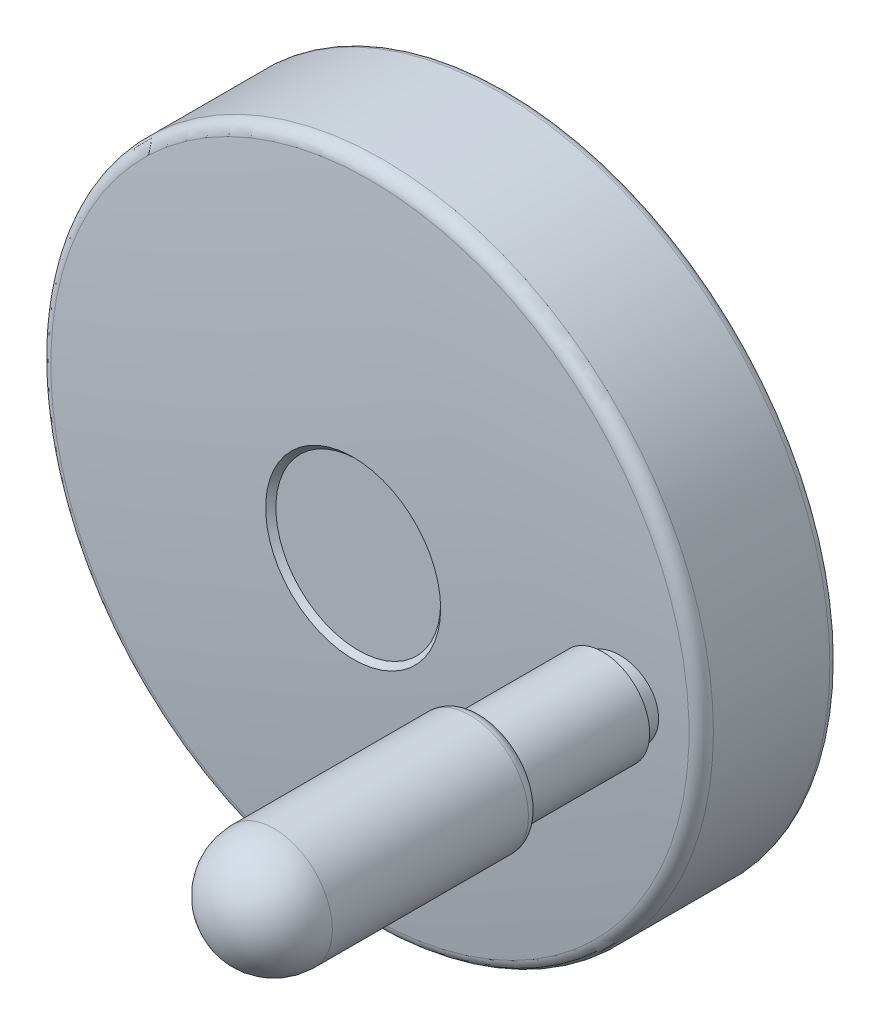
ISO-10303-21;
HEADER;
FILE_DESCRIPTION(('STEP AP214'),'2;1');
FILE_NAME('part.step','',(''),(''),'','','');
FILE_SCHEMA(('AUTOMOTIVE_DESIGN { 1 0 10303 214 1 1 1 1 }'));
ENDSEC;
DATA;
#1=APPLICATION_CONTEXT('core data for automotive mechanical design processes');
#2=APPLICATION_PROTOCOL_DEFINITION('international standard','automotive_design',2000,#1);
#3=PRODUCT_CONTEXT('',#1,'mechanical');
#4=PRODUCT('Part','Part','',(#3));
#5=PRODUCT_RELATED_PRODUCT_CATEGORY('part','',(#4));
#6=PRODUCT_DEFINITION_FORMATION('','',#4);
#7=PRODUCT_DEFINITION_CONTEXT('part definition',#1,'design');
#8=PRODUCT_DEFINITION('design','',#6,#7);
#9=PRODUCT_DEFINITION_SHAPE('','',#8);
#10=(LENGTH_UNIT() NAMED_UNIT(*) SI_UNIT(.MILLI.,.METRE.));
#11=(NAMED_UNIT(*) PLANE_ANGLE_UNIT() SI_UNIT($,.RADIAN.));
#12=(NAMED_UNIT(*) SI_UNIT($,.STERADIAN.) SOLID_ANGLE_UNIT());
#13=UNCERTAINTY_MEASURE_WITH_UNIT(LENGTH_MEASURE(1.E-05),#10,'distance_accuracy_value','');
#14=(GEOMETRIC_REPRESENTATION_CONTEXT(3) GLOBAL_UNCERTAINTY_ASSIGNED_CONTEXT((#13)) GLOBAL_UNIT_ASSIGNED_CONTEXT((#10,
#11,#12)) REPRESENTATION_CONTEXT('',''));
#15=CARTESIAN_POINT('',(0.,0.,0.));
#16=DIRECTION('',(0.,0.,1.));
#17=DIRECTION('',(1.,0.,0.));
#18=AXIS2_PLACEMENT_3D('',#15,#16,#17);
#19=CARTESIAN_POINT('',(0.,0.,34.));
#20=DIRECTION('',(0.,0.,1.));
#21=DIRECTION('',(0.,1.,0.));
#22=AXIS2_PLACEMENT_3D('',#19,#20,#21);
#23=PLANE('',#22);
#24=CARTESIAN_POINT('',(39.,0.,34.));
#25=DIRECTION('',(0.,0.,1.));
#26=DIRECTION('',(0.,1.,0.));
#27=AXIS2_PLACEMENT_3D('',#24,#25,#26);
#28=CIRCLE('',#27,5.4375);
#29=CARTESIAN_POINT('',(39.,5.43749999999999,34.));
#30=VERTEX_POINT('',#29);
#31=EDGE_CURVE('E349',#30,#30,#28,.T.);
#32=ORIENTED_EDGE('',*,*,#31,.F.);
#33=EDGE_LOOP('',(#32));
#34=FACE_BOUND('',#33,.T.);
#35=CARTESIAN_POINT('',(39.,0.,34.));
#36=DIRECTION('',(0.,0.,-1.));
#37=DIRECTION('',(0.,-1.,0.));
#38=AXIS2_PLACEMENT_3D('',#35,#36,#37);
#39=CIRCLE('',#38,6.);
#40=CARTESIAN_POINT('',(39.,-6.,34.));
#41=VERTEX_POINT('',#40);
#42=EDGE_CURVE('E384',#41,#41,#39,.T.);
#43=ORIENTED_EDGE('',*,*,#42,.F.);
#44=EDGE_LOOP('',(#43));
#45=FACE_BOUND('',#44,.T.);
#46=ADVANCED_FACE('F15',(#34,#45),#23,.T.);
#47=CARTESIAN_POINT('',(39.,0.,31.));
#48=DIRECTION('',(0.,0.,-1.));
#49=DIRECTION('',(0.,-1.,0.));
#50=AXIS2_PLACEMENT_3D('',#47,#48,#49);
#51=CYLINDRICAL_SURFACE('',#50,6.);
#52=CARTESIAN_POINT('',(33.,0.,32.74646972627));
#53=CARTESIAN_POINT('',(33.0000009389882,0.167957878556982,32.746469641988));
#54=CARTESIAN_POINT('',(33.0070584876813,0.335946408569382,32.7458350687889));
#55=CARTESIAN_POINT('',(33.0352437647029,0.67076337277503,32.7433007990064));
#56=CARTESIAN_POINT('',(33.0563756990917,0.837591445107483,32.7414007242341));
#57=CARTESIAN_POINT('',(33.1126039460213,1.16913659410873,32.7363449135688));
#58=CARTESIAN_POINT('',(33.1477224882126,1.3338498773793,32.7331871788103));
#59=CARTESIAN_POINT('',(33.2317016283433,1.65984619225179,32.7256359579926));
#60=CARTESIAN_POINT('',(33.2805732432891,1.82112636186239,32.7212414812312));
#61=CARTESIAN_POINT('',(33.3915896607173,2.13868510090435,32.7112588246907));
#62=CARTESIAN_POINT('',(33.4537102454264,2.29497220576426,32.7056728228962));
#63=CARTESIAN_POINT('',(33.5908580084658,2.60181401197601,32.6933399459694));
#64=CARTESIAN_POINT('',(33.6658910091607,2.75236608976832,32.6865925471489));
#65=CARTESIAN_POINT('',(33.8283063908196,3.04660896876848,32.67198682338));
#66=CARTESIAN_POINT('',(33.9156894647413,3.19029938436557,32.6641284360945));
#67=CARTESIAN_POINT('',(34.1021303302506,3.4697365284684,32.6473612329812));
#68=CARTESIAN_POINT('',(34.2011828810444,3.60548678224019,32.6384528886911));
#69=CARTESIAN_POINT('',(34.4105368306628,3.868480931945,32.6196238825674));
#70=CARTESIAN_POINT('',(34.5208648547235,3.99570346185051,32.6097008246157));
#71=CARTESIAN_POINT('',(34.7516660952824,4.24027152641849,32.5889414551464));
#72=CARTESIAN_POINT('',(34.8721294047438,4.35762648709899,32.5781060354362));
#73=CARTESIAN_POINT('',(35.1224921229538,4.58183185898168,32.5555855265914));
#74=CARTESIAN_POINT('',(35.2523959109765,4.68867734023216,32.5439000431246));
#75=CARTESIAN_POINT('',(35.5206970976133,4.89108337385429,32.5197639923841));
#76=CARTESIAN_POINT('',(35.6590964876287,4.98664126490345,32.5073132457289));
#77=CARTESIAN_POINT('',(35.9438733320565,5.16609261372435,32.4816928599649));
#78=CARTESIAN_POINT('',(36.0902767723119,5.24994450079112,32.4685208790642));
#79=CARTESIAN_POINT('',(36.3896344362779,5.40503648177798,32.4415862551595));
#80=CARTESIAN_POINT('',(36.5425910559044,5.47627191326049,32.4278233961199));
#81=CARTESIAN_POINT('',(36.8538629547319,5.60557650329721,32.3998141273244));
#82=CARTESIAN_POINT('',(37.0121762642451,5.66365044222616,32.3855678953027));
#83=CARTESIAN_POINT('',(37.3331552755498,5.7662838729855,32.3566823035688));
#84=CARTESIAN_POINT('',(37.4958225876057,5.8108382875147,32.342042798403));
#85=CARTESIAN_POINT('',(37.8248270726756,5.88621612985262,32.3124319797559));
#86=CARTESIAN_POINT('',(37.9911742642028,5.9169954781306,32.2974597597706));
#87=CARTESIAN_POINT('',(38.3259327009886,5.96441315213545,32.2673279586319));
#88=CARTESIAN_POINT('',(38.4943448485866,5.98104505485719,32.2521682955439));
#89=CARTESIAN_POINT('',(38.8319675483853,6.00002939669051,32.2217754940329));
#90=CARTESIAN_POINT('',(39.00117811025,6.00238166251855,32.2065423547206));
#91=CARTESIAN_POINT('',(39.3391201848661,5.99279224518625,32.1761175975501));
#92=CARTESIAN_POINT('',(39.5078518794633,5.9808570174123,32.1609259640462));
#93=CARTESIAN_POINT('',(39.8440908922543,5.94274356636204,32.1306513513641));
#94=CARTESIAN_POINT('',(40.0115946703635,5.91653385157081,32.1155686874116));
#95=CARTESIAN_POINT('',(40.343743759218,5.85004512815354,32.0856592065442));
#96=CARTESIAN_POINT('',(40.5083901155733,5.80977138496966,32.0708322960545));
#97=CARTESIAN_POINT('',(40.833778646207,5.7154144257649,32.0415285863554));
#98=CARTESIAN_POINT('',(40.9945192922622,5.66132589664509,32.0270519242));
#99=CARTESIAN_POINT('',(41.3108232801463,5.53974661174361,31.9985634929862));
#100=CARTESIAN_POINT('',(41.4663885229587,5.47226084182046,31.9845515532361));
#101=CARTESIAN_POINT('',(41.7712243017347,5.3243780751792,31.9570933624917));
#102=CARTESIAN_POINT('',(41.9204975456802,5.24398670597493,31.9436468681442));
#103=CARTESIAN_POINT('',(42.2117156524,5.07085509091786,31.9174128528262));
#104=CARTESIAN_POINT('',(42.3536622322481,4.97811775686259,31.9046251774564));
#105=CARTESIAN_POINT('',(42.6291782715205,4.7809774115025,31.8798034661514));
#106=CARTESIAN_POINT('',(42.7627516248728,4.67657988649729,31.8677690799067));
#107=CARTESIAN_POINT('',(43.0207558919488,4.45671145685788,31.8445230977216));
#108=CARTESIAN_POINT('',(43.1451777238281,4.34122980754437,31.833312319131));
#109=CARTESIAN_POINT('',(43.3833915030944,4.10054176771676,31.8118477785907));
#110=CARTESIAN_POINT('',(43.497220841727,3.97537268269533,31.8015906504));
#111=CARTESIAN_POINT('',(43.7139888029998,3.71576617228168,31.7820571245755));
#112=CARTESIAN_POINT('',(43.8169224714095,3.58132457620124,31.7727811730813));
#113=CARTESIAN_POINT('',(44.0110846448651,3.30418746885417,31.7552835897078));
#114=CARTESIAN_POINT('',(44.1023139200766,3.1614925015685,31.7470618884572));
#115=CARTESIAN_POINT('',(44.2723701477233,2.86892460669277,31.7317358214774));
#116=CARTESIAN_POINT('',(44.3512027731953,2.71905500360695,31.7246309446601));
#117=CARTESIAN_POINT('',(44.495778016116,2.41348899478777,31.7116006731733));
#118=CARTESIAN_POINT('',(44.5615493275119,2.25780627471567,31.7056726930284));
#119=CARTESIAN_POINT('',(44.6796916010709,1.94153919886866,31.6950243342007));
#120=CARTESIAN_POINT('',(44.7320733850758,1.78095891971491,31.6903029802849));
#121=CARTESIAN_POINT('',(44.8230489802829,1.4561921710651,31.6821029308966));
#122=CARTESIAN_POINT('',(44.8616649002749,1.29201193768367,31.6786222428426));
#123=CARTESIAN_POINT('',(44.924935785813,0.960995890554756,31.6729192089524));
#124=CARTESIAN_POINT('',(44.9495949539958,0.794160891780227,31.6706964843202));
#125=CARTESIAN_POINT('',(44.9781180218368,0.522551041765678,31.6681254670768));
#126=CARTESIAN_POINT('',(44.9863211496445,0.418216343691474,31.6673860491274));
#127=CARTESIAN_POINT('',(44.9972624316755,0.209258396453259,31.6663998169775));
#128=CARTESIAN_POINT('',(45.000000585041,0.104635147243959,31.6661530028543));
#129=CARTESIAN_POINT('',(44.999999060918,-0.167955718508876,31.6661531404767));
#130=CARTESIAN_POINT('',(44.9929416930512,-0.335942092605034,31.6667892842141));
#131=CARTESIAN_POINT('',(44.9647571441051,-0.670754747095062,31.6693297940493));
#132=CARTESIAN_POINT('',(44.9436257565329,-0.837580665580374,31.6712345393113));
#133=CARTESIAN_POINT('',(44.8873989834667,-1.16912152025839,31.6763026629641));
#134=CARTESIAN_POINT('',(44.8522813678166,-1.33383266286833,31.6794680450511));
#135=CARTESIAN_POINT('',(44.7683044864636,-1.65982470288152,31.6870373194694));
#136=CARTESIAN_POINT('',(44.7194342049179,-1.82110273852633,31.6914422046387));
#137=CARTESIAN_POINT('',(44.6084209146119,-2.13865716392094,31.7014481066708));
#138=CARTESIAN_POINT('',(44.5463021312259,-2.29494209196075,31.7070469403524));
#139=CARTESIAN_POINT('',(44.4091584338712,-2.60177964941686,31.7194075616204));
#140=CARTESIAN_POINT('',(44.3341276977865,-2.75232965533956,31.7261698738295));
#141=CARTESIAN_POINT('',(44.1717173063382,-3.04656858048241,31.7408070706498));
#142=CARTESIAN_POINT('',(44.0843369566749,-3.19025711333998,31.7486820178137));
#143=CARTESIAN_POINT('',(43.8979019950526,-3.46969074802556,31.7654835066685));
#144=CARTESIAN_POINT('',(43.7988526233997,-3.60543937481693,31.7744095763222));
#145=CARTESIAN_POINT('',(43.5895042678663,-3.86843211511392,31.7932748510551));
#146=CARTESIAN_POINT('',(43.4791785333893,-3.99565476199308,31.8032164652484));
#147=CARTESIAN_POINT('',(43.2483820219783,-4.24022325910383,31.8240130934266));
#148=CARTESIAN_POINT('',(43.127921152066,-4.3575785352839,31.8348672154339));
#149=CARTESIAN_POINT('',(42.8775634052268,-4.58178480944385,31.8574247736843));
#150=CARTESIAN_POINT('',(42.7476621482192,-4.68863087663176,31.8691286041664));
#151=CARTESIAN_POINT('',(42.4793660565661,-4.89103839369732,31.8933004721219));
#152=CARTESIAN_POINT('',(42.3409692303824,-4.98659718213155,31.9057686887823));
#153=CARTESIAN_POINT('',(42.0561950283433,-5.16605221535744,31.9314229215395));
#154=CARTESIAN_POINT('',(41.9097915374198,-5.24990668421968,31.9446112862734));
#155=CARTESIAN_POINT('',(41.6104334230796,-5.40500375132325,31.9715768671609));
#156=CARTESIAN_POINT('',(41.457476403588,-5.47624168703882,31.9853542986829));
#157=CARTESIAN_POINT('',(41.1462033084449,-5.6055511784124,32.0133904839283));
#158=CARTESIAN_POINT('',(40.9878892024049,-5.66362751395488,32.0276490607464));
#159=CARTESIAN_POINT('',(40.6669081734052,-5.76626558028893,32.0565567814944));
#160=CARTESIAN_POINT('',(40.5042396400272,-5.81082223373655,32.0712060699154));
#161=CARTESIAN_POINT('',(40.175231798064,-5.88620444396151,32.1008336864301));
#162=CARTESIAN_POINT('',(40.0088824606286,-5.91698588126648,32.1158129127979));
#163=CARTESIAN_POINT('',(39.6741192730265,-5.96440735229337,32.1459556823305));
#164=CARTESIAN_POINT('',(39.505704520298,-5.98104096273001,32.1611193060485));
#165=CARTESIAN_POINT('',(39.1680761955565,-6.00002825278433,32.1915168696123));
#166=CARTESIAN_POINT('',(38.9988626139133,-6.00238175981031,32.2067508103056));
#167=CARTESIAN_POINT('',(38.6609141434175,-5.99279427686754,32.2371739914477));
#168=CARTESIAN_POINT('',(38.4921790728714,-5.98085974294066,32.2523632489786));
#169=CARTESIAN_POINT('',(38.1559354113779,-5.94274733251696,32.2826297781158));
#170=CARTESIAN_POINT('',(37.9884303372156,-5.91653816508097,32.2977067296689));
#171=CARTESIAN_POINT('',(37.656278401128,-5.85005025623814,32.3276018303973));
#172=CARTESIAN_POINT('',(37.4916304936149,-5.80977678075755,32.3424200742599));
#173=CARTESIAN_POINT('',(37.1662386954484,-5.71542003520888,32.3717037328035));
#174=CARTESIAN_POINT('',(37.0054963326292,-5.66133145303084,32.3861690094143));
#175=CARTESIAN_POINT('',(36.6891888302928,-5.53975171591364,32.414632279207));
#176=CARTESIAN_POINT('',(36.5336217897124,-5.47226554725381,32.4286304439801));
#177=CARTESIAN_POINT('',(36.2287851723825,-5.32438296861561,32.4560588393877));
#178=CARTESIAN_POINT('',(36.0795127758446,-5.24399241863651,32.4694893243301));
#179=CARTESIAN_POINT('',(35.7882961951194,-5.07086255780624,32.4956897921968));
#180=CARTESIAN_POINT('',(35.6463502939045,-4.97812615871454,32.5084599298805));
#181=CARTESIAN_POINT('',(35.3708354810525,-4.78098781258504,32.5332455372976));
#182=CARTESIAN_POINT('',(35.2372626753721,-4.67659135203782,32.5452613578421));
#183=CARTESIAN_POINT('',(34.9792593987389,-4.45672520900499,32.5684696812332));
#184=CARTESIAN_POINT('',(34.8548380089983,-4.34124478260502,32.5796613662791));
#185=CARTESIAN_POINT('',(34.6166255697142,-4.10055993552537,32.6010877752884));
#186=CARTESIAN_POINT('',(34.5027970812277,-3.97539286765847,32.6113258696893));
#187=CARTESIAN_POINT('',(34.2860305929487,-3.7157906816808,32.6308219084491));
#188=CARTESIAN_POINT('',(34.1830975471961,-3.58135139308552,32.6400794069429));
#189=CARTESIAN_POINT('',(33.9889363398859,-3.30421917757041,32.6575412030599));
#190=CARTESIAN_POINT('',(33.8977074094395,-3.1615267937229,32.6657455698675));
#191=CARTESIAN_POINT('',(33.7276515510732,-2.86896433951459,32.6810385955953));
#192=CARTESIAN_POINT('',(33.6488189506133,-2.71909759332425,32.6881277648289));
#193=CARTESIAN_POINT('',(33.504242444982,-2.41353555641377,32.7011288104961));
#194=CARTESIAN_POINT('',(33.4384700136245,-2.25785387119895,32.7070432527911));
#195=CARTESIAN_POINT('',(33.3203254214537,-1.94158894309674,32.7176669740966));
#196=CARTESIAN_POINT('',(33.2679424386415,-1.78100977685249,32.7223772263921));
#197=CARTESIAN_POINT('',(33.1769643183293,-1.45624526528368,32.7305578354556));
#198=CARTESIAN_POINT('',(33.1383470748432,-1.2920661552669,32.7340301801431));
#199=CARTESIAN_POINT('',(33.0750733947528,-0.961052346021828,32.7397195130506));
#200=CARTESIAN_POINT('',(33.050412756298,-0.794218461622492,32.7419368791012));
#201=CARTESIAN_POINT('',(33.0218860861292,-0.522600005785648,32.7445018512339));
#202=CARTESIAN_POINT('',(33.0136814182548,-0.418255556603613,32.7452395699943));
#203=CARTESIAN_POINT('',(33.0027380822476,-0.209278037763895,32.7462235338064));
#204=CARTESIAN_POINT('',(32.99999941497,-0.10464496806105,32.7464697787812));
#205=CARTESIAN_POINT('',(33.,0.,32.74646972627));
#206=B_SPLINE_CURVE_WITH_KNOTS('',3,(#52,#53,#54,#55,#56,#57,#58,#59,#60,#61,#62,#63,#64,#65,
#66,#67,#68,#69,#70,#71,#72,#73,#74,#75,#76,#77,#78,#79,#80,#81,#82,#83,#84,#85,#86,#87,#88,#89,
#90,#91,#92,#93,#94,#95,#96,#97,#98,#99,#100,#101,#102,#103,#104,#105,#106,#107,#108,#109,#110,
#111,#112,#113,#114,#115,#116,#117,#118,#119,#120,#121,#122,#123,#124,#125,#126,#127,#128,#129,
#130,#131,#132,#133,#134,#135,#136,#137,#138,#139,#140,#141,#142,#143,#144,#145,#146,#147,#148,
#149,#150,#151,#152,#153,#154,#155,#156,#157,#158,#159,#160,#161,#162,#163,#164,#165,#166,#167,
#168,#169,#170,#171,#172,#173,#174,#175,#176,#177,#178,#179,#180,#181,#182,#183,#184,#185,#186,
#187,#188,#189,#190,#191,#192,#193,#194,#195,#196,#197,#198,#199,#200,#201,#202,#203,#204,#205),
.UNSPECIFIED.,.T.,.F.,(4,2,2,2,2,2,2,2,2,2,2,2,2,2,2,2,2,2,2,2,2,2,2,2,2,2,2,2,2,2,2,2,2,2,2,2,
2,2,2,2,2,2,2,2,2,2,2,2,2,2,2,2,2,2,2,2,2,2,2,2,2,2,2,2,2,2,2,2,2,2,2,2,2,2,2,2,4),(0.,
0.503777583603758,1.00770578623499,1.51243812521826,2.01757594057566,2.52179820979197,
3.02624843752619,3.53072698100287,4.03497981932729,4.54045215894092,5.04543602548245,
5.55065565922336,6.05599417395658,6.56308393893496,7.07036071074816,7.57745293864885,
8.0847353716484,8.59362967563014,9.10275489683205,9.61188629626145,10.1207877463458,
10.6308164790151,11.1406544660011,11.6506888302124,12.1605337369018,12.6701569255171,
13.1796601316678,13.6889246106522,14.1986878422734,14.7065773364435,15.2146967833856,
15.722782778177,16.2306355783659,16.7373600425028,17.2436736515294,17.7491703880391,
18.2545148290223,18.5683603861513,18.8822059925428,19.3859771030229,19.8898988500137,
20.3946247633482,20.8997561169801,21.4039716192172,21.908415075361,22.4128869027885,
22.9171330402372,23.4226044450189,23.9275873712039,24.4328061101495,24.9381437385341,
25.4452412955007,25.9525258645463,26.4596259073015,26.9669161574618,27.4758197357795,
27.9849542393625,28.494094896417,29.0030055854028,29.5130363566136,30.0228763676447,
30.5329127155,31.0427595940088,31.5523755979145,32.0618716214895,32.5711289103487,
33.08088491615,33.5887647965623,34.0968746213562,34.6049510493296,35.1127943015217,
35.619515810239,36.1258264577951,36.6313203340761,37.1366619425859,37.450536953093,
37.7644120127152),.UNSPECIFIED.);
#207=CARTESIAN_POINT('',(33.,0.,32.74646972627));
#208=VERTEX_POINT('',#207);
#209=EDGE_CURVE('E353',#208,#208,#206,.T.);
#210=ORIENTED_EDGE('',*,*,#209,.F.);
#211=EDGE_LOOP('',(#210));
#212=FACE_BOUND('',#211,.T.);
#213=ORIENTED_EDGE('',*,*,#42,.T.);
#214=EDGE_LOOP('',(#213));
#215=FACE_BOUND('',#214,.T.);
#216=ADVANCED_FACE('F364',(#212,#215),#51,.T.);
#217=CARTESIAN_POINT('',(2.81085775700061E-13,0.,-401.000000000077));
#218=DIRECTION('',(-1.,0.,0.));
#219=DIRECTION('',(0.,0.,1.));
#220=AXIS2_PLACEMENT_3D('',#217,#218,#219);
#221=SPHERICAL_SURFACE('',#220,435.000000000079);
#222=CARTESIAN_POINT('',(0.,0.,31.2057017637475));
#223=DIRECTION('',(0.,0.,1.));
#224=DIRECTION('',(0.,1.,0.));
#225=AXIS2_PLACEMENT_3D('',#222,#223,#224);
#226=CIRCLE('',#225,49.2263279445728);
#227=CARTESIAN_POINT('',(0.,49.2263279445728,31.2057017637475));
#228=VERTEX_POINT('',#227);
#229=EDGE_CURVE('E346',#228,#228,#226,.T.);
#230=ORIENTED_EDGE('',*,*,#229,.T.);
#231=EDGE_LOOP('',(#230));
#232=FACE_BOUND('',#231,.T.);
#233=CARTESIAN_POINT('',(0.,0.,33.7904667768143));
#234=DIRECTION('',(0.,0.,1.));
#235=DIRECTION('',(1.,0.,0.));
#236=AXIS2_PLACEMENT_3D('',#233,#234,#235);
#237=CIRCLE('',#236,13.5);
#238=CARTESIAN_POINT('',(13.5,0.,33.7904667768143));
#239=VERTEX_POINT('',#238);
#240=EDGE_CURVE('E350',#239,#239,#237,.F.);
#241=ORIENTED_EDGE('',*,*,#240,.T.);
#242=EDGE_LOOP('',(#241));
#243=FACE_BOUND('',#242,.T.);
#244=ORIENTED_EDGE('',*,*,#209,.T.);
#245=EDGE_LOOP('',(#244));
#246=FACE_BOUND('',#245,.T.);
#247=ADVANCED_FACE('F368',(#232,#243,#246),#221,.T.);
#248=CARTESIAN_POINT('',(0.,0.,29.21854911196));
#249=DIRECTION('',(0.,0.,1.));
#250=DIRECTION('',(0.,1.,0.));
#251=AXIS2_PLACEMENT_3D('',#248,#249,#250);
#252=TOROIDAL_SURFACE('',#251,49.,2.00000000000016);
#253=CARTESIAN_POINT('',(0.,0.,29.21854911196));
#254=DIRECTION('',(0.,0.,1.));
#255=DIRECTION('',(0.,1.,0.));
#256=AXIS2_PLACEMENT_3D('',#253,#254,#255);
#257=CIRCLE('',#256,51.);
#258=CARTESIAN_POINT('',(0.,51.,29.21854911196));
#259=VERTEX_POINT('',#258);
#260=EDGE_CURVE('E361',#259,#259,#257,.T.);
#261=ORIENTED_EDGE('',*,*,#260,.T.);
#262=EDGE_LOOP('',(#261));
#263=FACE_BOUND('',#262,.T.);
#264=ORIENTED_EDGE('',*,*,#229,.F.);
#265=EDGE_LOOP('',(#264));
#266=FACE_BOUND('',#265,.T.);
#267=ADVANCED_FACE('F373',(#263,#266),#252,.T.);
#268=CARTESIAN_POINT('',(0.,0.,33.7904667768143));
#269=DIRECTION('',(0.,0.,1.));
#270=DIRECTION('',(1.,0.,0.));
#271=AXIS2_PLACEMENT_3D('',#268,#269,#270);
#272=CONICAL_SURFACE('',#271,13.5,0.78539816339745);
#273=CARTESIAN_POINT('',(0.,0.,33.));
#274=DIRECTION('',(0.,0.,1.));
#275=DIRECTION('',(1.,0.,0.));
#276=AXIS2_PLACEMENT_3D('',#273,#274,#275);
#277=CIRCLE('',#276,12.7095332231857);
#278=CARTESIAN_POINT('',(12.7095332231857,0.,33.));
#279=VERTEX_POINT('',#278);
#280=EDGE_CURVE('E362',#279,#279,#277,.T.);
#281=ORIENTED_EDGE('',*,*,#280,.F.);
#282=EDGE_LOOP('',(#281));
#283=FACE_BOUND('',#282,.T.);
#284=ORIENTED_EDGE('',*,*,#240,.F.);
#285=EDGE_LOOP('',(#284));
#286=FACE_BOUND('',#285,.T.);
#287=ADVANCED_FACE('F582',(#283,#286),#272,.F.);
#288=CARTESIAN_POINT('',(0.,0.,20.2342745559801));
#289=DIRECTION('',(0.,0.,-1.));
#290=DIRECTION('',(-1.,0.,0.));
#291=AXIS2_PLACEMENT_3D('',#288,#289,#290);
#292=CYLINDRICAL_SURFACE('',#291,51.);
#293=CARTESIAN_POINT('',(0.,0.,11.25));
#294=DIRECTION('',(0.,0.,-1.));
#295=DIRECTION('',(-1.,0.,0.));
#296=AXIS2_PLACEMENT_3D('',#293,#294,#295);
#297=CIRCLE('',#296,51.);
#298=CARTESIAN_POINT('',(-51.,0.,11.25));
#299=VERTEX_POINT('',#298);
#300=EDGE_CURVE('E381',#299,#299,#297,.F.);
#301=ORIENTED_EDGE('',*,*,#300,.T.);
#302=EDGE_LOOP('',(#301));
#303=FACE_BOUND('',#302,.T.);
#304=ORIENTED_EDGE('',*,*,#260,.F.);
#305=EDGE_LOOP('',(#304));
#306=FACE_BOUND('',#305,.T.);
#307=ADVANCED_FACE('F574',(#303,#306),#292,.T.);
#308=CARTESIAN_POINT('',(-6.35476661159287,0.,33.));
#309=DIRECTION('',(0.,0.,1.));
#310=DIRECTION('',(0.,1.,0.));
#311=AXIS2_PLACEMENT_3D('',#308,#309,#310);
#312=PLANE('',#311);
#313=ORIENTED_EDGE('',*,*,#280,.T.);
#314=EDGE_LOOP('',(#313));
#315=FACE_BOUND('',#314,.T.);
#316=ADVANCED_FACE('F396',(#315),#312,.T.);
#317=CARTESIAN_POINT('',(0.,0.,11.25));
#318=DIRECTION('',(0.,0.,1.));
#319=DIRECTION('',(0.,1.,0.));
#320=AXIS2_PLACEMENT_3D('',#317,#318,#319);
#321=TOROIDAL_SURFACE('',#320,49.75,1.25);
#322=ORIENTED_EDGE('',*,*,#300,.F.);
#323=EDGE_LOOP('',(#322));
#324=FACE_BOUND('',#323,.T.);
#325=CARTESIAN_POINT('',(0.,0.,10.));
#326=DIRECTION('',(0.,0.,1.));
#327=DIRECTION('',(0.,-1.,0.));
#328=AXIS2_PLACEMENT_3D('',#325,#326,#327);
#329=CIRCLE('',#328,49.75);
#330=CARTESIAN_POINT('',(0.,-49.75,10.));
#331=VERTEX_POINT('',#330);
#332=CARTESIAN_POINT('',(0.,49.75,10.));
#333=VERTEX_POINT('',#332);
#334=EDGE_CURVE('E436',#331,#333,#329,.T.);
#335=ORIENTED_EDGE('',*,*,#334,.T.);
#336=CARTESIAN_POINT('',(0.,0.,10.));
#337=DIRECTION('',(0.,0.,1.));
#338=DIRECTION('',(0.,1.,0.));
#339=AXIS2_PLACEMENT_3D('',#336,#337,#338);
#340=CIRCLE('',#339,49.75);
#341=CARTESIAN_POINT('',(-49.75,0.,10.));
#342=VERTEX_POINT('',#341);
#343=EDGE_CURVE('E435',#333,#342,#340,.T.);
#344=ORIENTED_EDGE('',*,*,#343,.T.);
#345=CARTESIAN_POINT('',(0.,0.,10.));
#346=DIRECTION('',(0.,0.,1.));
#347=DIRECTION('',(-1.,0.,0.));
#348=AXIS2_PLACEMENT_3D('',#345,#346,#347);
#349=CIRCLE('',#348,49.75);
#350=EDGE_CURVE('E35',#342,#331,#349,.T.);
#351=ORIENTED_EDGE('',*,*,#350,.T.);
#352=EDGE_LOOP('',(#335,#344,#351));
#353=FACE_BOUND('',#352,.T.);
#354=ADVANCED_FACE('F390',(#324,#353),#321,.T.);
#355=CARTESIAN_POINT('',(-49.355,0.,10.));
#356=DIRECTION('',(0.,0.,-1.));
#357=DIRECTION('',(-1.,0.,0.));
#358=AXIS2_PLACEMENT_3D('',#355,#356,#357);
#359=PLANE('',#358);
#360=CARTESIAN_POINT('',(0.,0.,10.));
#361=DIRECTION('',(0.,0.,-1.));
#362=DIRECTION('',(-1.,0.,0.));
#363=AXIS2_PLACEMENT_3D('',#360,#361,#362);
#364=CIRCLE('',#363,48.96);
#365=CARTESIAN_POINT('',(-48.96,0.,9.99999999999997));
#366=VERTEX_POINT('',#365);
#367=EDGE_CURVE('E276',#366,#366,#364,.F.);
#368=ORIENTED_EDGE('',*,*,#367,.T.);
#369=EDGE_LOOP('',(#368));
#370=FACE_BOUND('',#369,.T.);
#371=ORIENTED_EDGE('',*,*,#343,.F.);
#372=ORIENTED_EDGE('',*,*,#334,.F.);
#373=ORIENTED_EDGE('',*,*,#350,.F.);
#374=EDGE_LOOP('',(#371,#372,#373));
#375=FACE_BOUND('',#374,.T.);
#376=ADVANCED_FACE('F395',(#370,#375),#359,.T.);
#377=CARTESIAN_POINT('',(0.,0.,11.8));
#378=DIRECTION('',(0.,0.,-1.));
#379=DIRECTION('',(-1.,0.,0.));
#380=AXIS2_PLACEMENT_3D('',#377,#378,#379);
#381=CYLINDRICAL_SURFACE('',#380,48.96);
#382=ORIENTED_EDGE('',*,*,#367,.F.);
#383=EDGE_LOOP('',(#382));
#384=FACE_BOUND('',#383,.T.);
#385=CARTESIAN_POINT('',(0.,0.,13.6));
#386=DIRECTION('',(0.,0.,-1.));
#387=DIRECTION('',(-1.,0.,0.));
#388=AXIS2_PLACEMENT_3D('',#385,#386,#387);
#389=CIRCLE('',#388,48.96);
#390=CARTESIAN_POINT('',(-48.96,0.,13.6));
#391=VERTEX_POINT('',#390);
#392=EDGE_CURVE('E277',#391,#391,#389,.T.);
#393=ORIENTED_EDGE('',*,*,#392,.F.);
#394=EDGE_LOOP('',(#393));
#395=FACE_BOUND('',#394,.T.);
#396=ADVANCED_FACE('F270',(#384,#395),#381,.F.);
#397=CARTESIAN_POINT('',(39.,0.,25.5));
#398=DIRECTION('',(0.,0.,1.));
#399=DIRECTION('',(0.,1.,0.));
#400=AXIS2_PLACEMENT_3D('',#397,#398,#399);
#401=CYLINDRICAL_SURFACE('',#400,2.4585);
#402=CARTESIAN_POINT('',(39.,0.,21.0719999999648));
#403=DIRECTION('',(0.,0.,1.));
#404=DIRECTION('',(0.,1.,0.));
#405=AXIS2_PLACEMENT_3D('',#402,#403,#404);
#406=CIRCLE('',#405,2.4585);
#407=CARTESIAN_POINT('',(39.,2.45849999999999,21.0719999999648));
#408=VERTEX_POINT('',#407);
#409=EDGE_CURVE('E9',#408,#408,#406,.T.);
#410=ORIENTED_EDGE('',*,*,#409,.T.);
#411=EDGE_LOOP('',(#410));
#412=FACE_BOUND('',#411,.T.);
#413=CARTESIAN_POINT('',(39.,0.,17.5415));
#414=DIRECTION('',(0.,0.,1.));
#415=DIRECTION('',(0.,1.,0.));
#416=AXIS2_PLACEMENT_3D('',#413,#414,#415);
#417=CIRCLE('',#416,2.4585);
#418=CARTESIAN_POINT('',(39.,2.4585,17.5415));
#419=VERTEX_POINT('',#418);
#420=EDGE_CURVE('E274',#419,#419,#417,.T.);
#421=ORIENTED_EDGE('',*,*,#420,.F.);
#422=EDGE_LOOP('',(#421));
#423=FACE_BOUND('',#422,.T.);
#424=ADVANCED_FACE('F266',(#412,#423),#401,.F.);
#425=CARTESIAN_POINT('',(39.,0.,17.0000000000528));
#426=DIRECTION('',(0.,0.,-1.));
#427=DIRECTION('',(0.,-1.,0.));
#428=AXIS2_PLACEMENT_3D('',#425,#426,#427);
#429=CONICAL_SURFACE('',#428,2.99999999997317,0.785398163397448);
#430=ORIENTED_EDGE('',*,*,#420,.T.);
#431=EDGE_LOOP('',(#430));
#432=FACE_BOUND('',#431,.T.);
#433=CARTESIAN_POINT('',(39.,0.,16.9999999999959));
#434=DIRECTION('',(0.,0.,-1.));
#435=DIRECTION('',(0.,-1.,0.));
#436=AXIS2_PLACEMENT_3D('',#433,#434,#435);
#437=CIRCLE('',#436,3.00000000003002);
#438=CARTESIAN_POINT('',(39.,-3.00000000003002,16.9999999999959));
#439=VERTEX_POINT('',#438);
#440=EDGE_CURVE('E283',#439,#439,#437,.F.);
#441=ORIENTED_EDGE('',*,*,#440,.F.);
#442=EDGE_LOOP('',(#441));
#443=FACE_BOUND('',#442,.T.);
#444=ADVANCED_FACE('F269',(#432,#443),#429,.F.);
#445=CARTESIAN_POINT('',(42.3,0.,17.));
#446=DIRECTION('',(0.,0.,1.));
#447=DIRECTION('',(0.,1.,0.));
#448=AXIS2_PLACEMENT_3D('',#445,#446,#447);
#449=PLANE('',#448);
#450=ORIENTED_EDGE('',*,*,#440,.T.);
#451=EDGE_LOOP('',(#450));
#452=FACE_BOUND('',#451,.T.);
#453=CARTESIAN_POINT('',(39.,0.,17.));
#454=DIRECTION('',(0.,0.,1.));
#455=DIRECTION('',(0.,1.,0.));
#456=AXIS2_PLACEMENT_3D('',#453,#454,#455);
#457=CIRCLE('',#456,3.6);
#458=CARTESIAN_POINT('',(39.,3.6,17.));
#459=VERTEX_POINT('',#458);
#460=EDGE_CURVE('E291',#459,#459,#457,.T.);
#461=ORIENTED_EDGE('',*,*,#460,.F.);
#462=EDGE_LOOP('',(#461));
#463=FACE_BOUND('',#462,.T.);
#464=ADVANCED_FACE('F489',(#452,#463),#449,.F.);
#465=CARTESIAN_POINT('',(39.,0.,8.5));
#466=DIRECTION('',(0.,0.,1.));
#467=DIRECTION('',(0.,1.,0.));
#468=AXIS2_PLACEMENT_3D('',#465,#466,#467);
#469=CYLINDRICAL_SURFACE('',#468,3.6);
#470=CARTESIAN_POINT('',(35.6551589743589,-1.33117936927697,13.6));
#471=CARTESIAN_POINT('',(35.6298127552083,-1.26750935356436,13.6277047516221));
#472=CARTESIAN_POINT('',(35.6060345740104,-1.2024530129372,13.6537276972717));
#473=CARTESIAN_POINT('',(35.5619033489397,-1.06975467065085,13.7020707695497));
#474=CARTESIAN_POINT('',(35.5415545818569,-1.00210956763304,13.7243862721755));
#475=CARTESIAN_POINT('',(35.5046580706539,-0.8646634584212,13.7648801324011));
#476=CARTESIAN_POINT('',(35.488105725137,-0.794865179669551,13.7830634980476));
#477=CARTESIAN_POINT('',(35.4590718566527,-0.653477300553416,13.8149769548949));
#478=CARTESIAN_POINT('',(35.4465875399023,-0.581888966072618,13.8287101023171));
#479=CARTESIAN_POINT('',(35.4242827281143,-0.425901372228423,13.853255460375));
#480=CARTESIAN_POINT('',(35.4151960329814,-0.341266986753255,13.8632619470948));
#481=CARTESIAN_POINT('',(35.4030565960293,-0.171085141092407,13.8766320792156));
#482=CARTESIAN_POINT('',(35.4000006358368,-0.0855381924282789,13.879999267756));
#483=CARTESIAN_POINT('',(35.3999994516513,0.0737685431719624,13.8800006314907));
#484=CARTESIAN_POINT('',(35.4022712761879,0.147530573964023,13.8774974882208));
#485=CARTESIAN_POINT('',(35.411308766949,0.294474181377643,13.8675430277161));
#486=CARTESIAN_POINT('',(35.4180762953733,0.367655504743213,13.8600896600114));
#487=CARTESIAN_POINT('',(35.4359822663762,0.512981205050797,13.840379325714));
#488=CARTESIAN_POINT('',(35.4471299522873,0.585123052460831,13.8281122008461));
#489=CARTESIAN_POINT('',(35.4735727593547,0.727717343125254,13.7990348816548));
#490=CARTESIAN_POINT('',(35.4888686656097,0.798169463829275,13.7822238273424));
#491=CARTESIAN_POINT('',(35.5261228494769,0.948194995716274,13.741315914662));
#492=CARTESIAN_POINT('',(35.5487589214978,1.02739778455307,13.7164800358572));
#493=CARTESIAN_POINT('',(35.5986334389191,1.18207465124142,13.6618284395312));
#494=CARTESIAN_POINT('',(35.625847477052,1.25756589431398,13.6320391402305));
#495=CARTESIAN_POINT('',(35.6551589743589,1.33117936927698,13.6));
#496=B_SPLINE_CURVE_WITH_KNOTS('',3,(#470,#471,#472,#473,#474,#475,#476,#477,#478,#479,#480,
#481,#482,#483,#484,#485,#486,#487,#488,#489,#490,#491,#492,#493,#494,#495),.UNSPECIFIED.,.F.,
.F.,(4,2,2,2,2,2,2,2,2,2,2,2,4),(0.,0.221744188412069,0.443762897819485,0.665511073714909,
0.887106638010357,1.14375645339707,1.40026926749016,1.6214871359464,1.84279669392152,
2.06457580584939,2.28639692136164,2.54414214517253,2.80055440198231),.UNSPECIFIED.);
#497=CARTESIAN_POINT('',(35.655158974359,-1.3311793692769,13.6));
#498=VERTEX_POINT('',#497);
#499=CARTESIAN_POINT('',(35.655158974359,1.33117936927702,13.6));
#500=VERTEX_POINT('',#499);
#501=EDGE_CURVE('E300',#498,#500,#496,.T.);
#502=ORIENTED_EDGE('',*,*,#501,.T.);
#503=CARTESIAN_POINT('',(39.,0.,13.6));
#504=DIRECTION('',(0.,0.,1.));
#505=DIRECTION('',(0.,1.,0.));
#506=AXIS2_PLACEMENT_3D('',#503,#504,#505);
#507=CIRCLE('',#506,3.6);
#508=EDGE_CURVE('E295',#498,#500,#507,.T.);
#509=ORIENTED_EDGE('',*,*,#508,.F.);
#510=EDGE_LOOP('',(#502,#509));
#511=FACE_BOUND('',#510,.T.);
#512=ORIENTED_EDGE('',*,*,#460,.T.);
#513=EDGE_LOOP('',(#512));
#514=FACE_BOUND('',#513,.T.);
#515=ADVANCED_FACE('F460',(#511,#514),#469,.F.);
#516=CARTESIAN_POINT('',(0.,0.,13.6));
#517=DIRECTION('',(0.,0.,-1.));
#518=DIRECTION('',(-1.,0.,0.));
#519=AXIS2_PLACEMENT_3D('',#516,#517,#518);
#520=CONICAL_SURFACE('',#519,35.68,0.785398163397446);
#521=CARTESIAN_POINT('',(0.,0.,14.6));
#522=DIRECTION('',(0.,0.,-1.));
#523=DIRECTION('',(-1.,0.,0.));
#524=AXIS2_PLACEMENT_3D('',#521,#522,#523);
#525=CIRCLE('',#524,34.68);
#526=CARTESIAN_POINT('',(-34.68,0.,14.6));
#527=VERTEX_POINT('',#526);
#528=EDGE_CURVE('E296',#527,#527,#525,.T.);
#529=ORIENTED_EDGE('',*,*,#528,.F.);
#530=EDGE_LOOP('',(#529));
#531=FACE_BOUND('',#530,.T.);
#532=CARTESIAN_POINT('',(0.,0.,13.6));
#533=DIRECTION('',(0.,0.,-1.));
#534=DIRECTION('',(-1.,0.,0.));
#535=AXIS2_PLACEMENT_3D('',#532,#533,#534);
#536=CIRCLE('',#535,35.68);
#537=EDGE_CURVE('E299',#500,#498,#536,.F.);
#538=ORIENTED_EDGE('',*,*,#537,.F.);
#539=ORIENTED_EDGE('',*,*,#501,.F.);
#540=EDGE_LOOP('',(#538,#539));
#541=FACE_BOUND('',#540,.T.);
#542=ADVANCED_FACE('F464',(#531,#541),#520,.F.);
#543=CARTESIAN_POINT('',(-41.1063675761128,0.,13.6));
#544=DIRECTION('',(0.,0.,-1.));
#545=DIRECTION('',(0.,-1.,0.));
#546=AXIS2_PLACEMENT_3D('',#543,#544,#545);
#547=PLANE('',#546);
#548=CARTESIAN_POINT('',(0.,0.,13.6));
#549=DIRECTION('',(0.,0.,1.));
#550=DIRECTION('',(1.,0.,0.));
#551=AXIS2_PLACEMENT_3D('',#548,#549,#550);
#552=CIRCLE('',#551,46.5327351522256);
#553=CARTESIAN_POINT('',(46.5327351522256,0.,13.6));
#554=VERTEX_POINT('',#553);
#555=EDGE_CURVE('E448',#554,#554,#552,.T.);
#556=ORIENTED_EDGE('',*,*,#555,.F.);
#557=EDGE_LOOP('',(#556));
#558=FACE_BOUND('',#557,.T.);
#559=ORIENTED_EDGE('',*,*,#508,.T.);
#560=ORIENTED_EDGE('',*,*,#537,.T.);
#561=EDGE_LOOP('',(#559,#560));
#562=FACE_BOUND('',#561,.T.);
#563=ADVANCED_FACE('F468',(#558,#562),#547,.T.);
#564=CARTESIAN_POINT('',(0.,0.,19.0568720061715));
#565=DIRECTION('',(0.,0.,-1.));
#566=DIRECTION('',(-1.,0.,0.));
#567=AXIS2_PLACEMENT_3D('',#564,#565,#566);
#568=CYLINDRICAL_SURFACE('',#567,34.68);
#569=CARTESIAN_POINT('',(0.,0.,23.513744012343));
#570=DIRECTION('',(0.,0.,-1.));
#571=DIRECTION('',(-1.,0.,0.));
#572=AXIS2_PLACEMENT_3D('',#569,#570,#571);
#573=CIRCLE('',#572,34.68);
#574=CARTESIAN_POINT('',(-34.68,0.,23.513744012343));
#575=VERTEX_POINT('',#574);
#576=EDGE_CURVE('E301',#575,#575,#573,.T.);
#577=ORIENTED_EDGE('',*,*,#576,.F.);
#578=EDGE_LOOP('',(#577));
#579=FACE_BOUND('',#578,.T.);
#580=ORIENTED_EDGE('',*,*,#528,.T.);
#581=EDGE_LOOP('',(#580));
#582=FACE_BOUND('',#581,.T.);
#583=ADVANCED_FACE('F316',(#579,#582),#568,.F.);
#584=CARTESIAN_POINT('',(0.,0.,23.8557841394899));
#585=DIRECTION('',(0.,0.,1.));
#586=DIRECTION('',(1.,0.,0.));
#587=AXIS2_PLACEMENT_3D('',#584,#585,#586);
#588=CONICAL_SURFACE('',#587,47.43,0.0872664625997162);
#589=CARTESIAN_POINT('',(0.,0.,23.8557841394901));
#590=DIRECTION('',(0.,0.,-1.));
#591=DIRECTION('',(-1.,0.,0.));
#592=AXIS2_PLACEMENT_3D('',#589,#590,#591);
#593=CIRCLE('',#592,47.43);
#594=CARTESIAN_POINT('',(-47.43,0.,23.8557841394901));
#595=VERTEX_POINT('',#594);
#596=EDGE_CURVE('E292',#595,#595,#593,.T.);
#597=ORIENTED_EDGE('',*,*,#596,.T.);
#598=EDGE_LOOP('',(#597));
#599=FACE_BOUND('',#598,.T.);
#600=ORIENTED_EDGE('',*,*,#555,.T.);
#601=EDGE_LOOP('',(#600));
#602=FACE_BOUND('',#601,.T.);
#603=ADVANCED_FACE('F314',(#599,#602),#588,.T.);
#604=CARTESIAN_POINT('',(0.,0.,23.513744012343));
#605=DIRECTION('',(0.,0.,1.));
#606=DIRECTION('',(0.,1.,0.));
#607=AXIS2_PLACEMENT_3D('',#604,#605,#606);
#608=TOROIDAL_SURFACE('',#607,33.0133333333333,1.66666666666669);
#609=ORIENTED_EDGE('',*,*,#576,.T.);
#610=EDGE_LOOP('',(#609));
#611=FACE_BOUND('',#610,.T.);
#612=CARTESIAN_POINT('',(0.,0.,25.1550902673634));
#613=DIRECTION('',(0.,0.,1.));
#614=DIRECTION('',(0.,1.,0.));
#615=AXIS2_PLACEMENT_3D('',#612,#613,#614);
#616=CIRCLE('',#615,32.7239197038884);
#617=CARTESIAN_POINT('',(0.,32.7239197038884,25.1550902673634));
#618=VERTEX_POINT('',#617);
#619=EDGE_CURVE('E304',#618,#618,#616,.F.);
#620=ORIENTED_EDGE('',*,*,#619,.F.);
#621=EDGE_LOOP('',(#620));
#622=FACE_BOUND('',#621,.T.);
#623=ADVANCED_FACE('F309',(#611,#622),#608,.F.);
#624=CARTESIAN_POINT('',(0.,0.,23.8));
#625=DIRECTION('',(0.,0.,-1.));
#626=DIRECTION('',(-1.,0.,0.));
#627=AXIS2_PLACEMENT_3D('',#624,#625,#626);
#628=CONICAL_SURFACE('',#627,48.0676156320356,1.48352986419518);
#629=CARTESIAN_POINT('',(0.,0.,23.8));
#630=DIRECTION('',(0.,0.,-1.));
#631=DIRECTION('',(-1.,0.,0.));
#632=AXIS2_PLACEMENT_3D('',#629,#630,#631);
#633=CIRCLE('',#632,48.0676156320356);
#634=CARTESIAN_POINT('',(-48.0676156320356,0.,23.8));
#635=VERTEX_POINT('',#634);
#636=EDGE_CURVE('E288',#635,#635,#633,.T.);
#637=ORIENTED_EDGE('',*,*,#636,.T.);
#638=EDGE_LOOP('',(#637));
#639=FACE_BOUND('',#638,.T.);
#640=ORIENTED_EDGE('',*,*,#596,.F.);
#641=EDGE_LOOP('',(#640));
#642=FACE_BOUND('',#641,.T.);
#643=ADVANCED_FACE('F313',(#639,#642),#628,.F.);
#644=CARTESIAN_POINT('',(0.,0.,25.1550902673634));
#645=DIRECTION('',(0.,0.,1.));
#646=DIRECTION('',(1.,0.,0.));
#647=AXIS2_PLACEMENT_3D('',#644,#645,#646);
#648=CONICAL_SURFACE('',#647,32.7239197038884,1.39626340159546);
#649=ORIENTED_EDGE('',*,*,#619,.T.);
#650=EDGE_LOOP('',(#649));
#651=FACE_BOUND('',#650,.T.);
#652=CARTESIAN_POINT('',(0.,0.,22.1755931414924));
#653=DIRECTION('',(0.,0.,1.));
#654=DIRECTION('',(-1.,0.,0.));
#655=AXIS2_PLACEMENT_3D('',#652,#653,#654);
#656=CIRCLE('',#655,15.8263518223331);
#657=CARTESIAN_POINT('',(-15.8263518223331,0.,22.1755931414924));
#658=VERTEX_POINT('',#657);
#659=EDGE_CURVE('E331',#658,#658,#656,.T.);
#660=ORIENTED_EDGE('',*,*,#659,.T.);
#661=EDGE_LOOP('',(#660));
#662=FACE_BOUND('',#661,.T.);
#663=ADVANCED_FACE('F318',(#651,#662),#648,.T.);
#664=CARTESIAN_POINT('',(0.,0.,13.6));
#665=DIRECTION('',(0.,0.,-1.));
#666=DIRECTION('',(-1.,0.,0.));
#667=AXIS2_PLACEMENT_3D('',#664,#665,#666);
#668=CONICAL_SURFACE('',#667,48.96,0.0872664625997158);
#669=ORIENTED_EDGE('',*,*,#392,.T.);
#670=EDGE_LOOP('',(#669));
#671=FACE_BOUND('',#670,.T.);
#672=ORIENTED_EDGE('',*,*,#636,.F.);
#673=EDGE_LOOP('',(#672));
#674=FACE_BOUND('',#673,.T.);
#675=ADVANCED_FACE('F321',(#671,#674),#668,.F.);
#676=CARTESIAN_POINT('',(0.,0.,21.1907853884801));
#677=DIRECTION('',(0.,0.,1.));
#678=DIRECTION('',(0.,1.,0.));
#679=AXIS2_PLACEMENT_3D('',#676,#677,#678);
#680=TOROIDAL_SURFACE('',#679,16.,1.);
#681=ORIENTED_EDGE('',*,*,#659,.F.);
#682=EDGE_LOOP('',(#681));
#683=FACE_BOUND('',#682,.T.);
#684=CARTESIAN_POINT('',(0.,0.,21.1907853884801));
#685=DIRECTION('',(0.,0.,1.));
#686=DIRECTION('',(0.,1.,0.));
#687=AXIS2_PLACEMENT_3D('',#684,#685,#686);
#688=CIRCLE('',#687,15.);
#689=CARTESIAN_POINT('',(0.,15.,21.1907853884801));
#690=VERTEX_POINT('',#689);
#691=EDGE_CURVE('E334',#690,#690,#688,.F.);
#692=ORIENTED_EDGE('',*,*,#691,.F.);
#693=EDGE_LOOP('',(#692));
#694=FACE_BOUND('',#693,.T.);
#695=ADVANCED_FACE('F323',(#683,#694),#680,.F.);
#696=CARTESIAN_POINT('',(0.,0.,10.6953926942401));
#697=DIRECTION('',(0.,0.,-1.));
#698=DIRECTION('',(-1.,0.,0.));
#699=AXIS2_PLACEMENT_3D('',#696,#697,#698);
#700=CYLINDRICAL_SURFACE('',#699,15.);
#701=ORIENTED_EDGE('',*,*,#691,.T.);
#702=EDGE_LOOP('',(#701));
#703=FACE_BOUND('',#702,.T.);
#704=CARTESIAN_POINT('',(0.,0.,0.200000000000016));
#705=DIRECTION('',(0.,0.,-1.));
#706=DIRECTION('',(-1.,0.,0.));
#707=AXIS2_PLACEMENT_3D('',#704,#705,#706);
#708=CIRCLE('',#707,15.);
#709=CARTESIAN_POINT('',(-15.,0.,0.200000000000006));
#710=VERTEX_POINT('',#709);
#711=EDGE_CURVE('E337',#710,#710,#708,.F.);
#712=ORIENTED_EDGE('',*,*,#711,.T.);
#713=EDGE_LOOP('',(#712));
#714=FACE_BOUND('',#713,.T.);
#715=ADVANCED_FACE('F326',(#703,#714),#700,.T.);
#716=CARTESIAN_POINT('',(-13.,0.,0.2));
#717=DIRECTION('',(0.,0.,-1.));
#718=DIRECTION('',(-1.,0.,0.));
#719=AXIS2_PLACEMENT_3D('',#716,#717,#718);
#720=PLANE('',#719);
#721=CARTESIAN_POINT('',(0.,0.,0.200000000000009));
#722=DIRECTION('',(0.,0.,-1.));
#723=DIRECTION('',(-1.,0.,0.));
#724=AXIS2_PLACEMENT_3D('',#721,#722,#723);
#725=CIRCLE('',#724,11.);
#726=CARTESIAN_POINT('',(-11.,0.,0.200000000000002));
#727=VERTEX_POINT('',#726);
#728=EDGE_CURVE('E919',#727,#727,#725,.F.);
#729=ORIENTED_EDGE('',*,*,#728,.T.);
#730=EDGE_LOOP('',(#729));
#731=FACE_BOUND('',#730,.T.);
#732=ORIENTED_EDGE('',*,*,#711,.F.);
#733=EDGE_LOOP('',(#732));
#734=FACE_BOUND('',#733,.T.);
#735=ADVANCED_FACE('F627',(#731,#734),#720,.T.);
#736=CARTESIAN_POINT('',(0.,0.,0.100000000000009));
#737=DIRECTION('',(0.,0.,-1.));
#738=DIRECTION('',(-1.,0.,0.));
#739=AXIS2_PLACEMENT_3D('',#736,#737,#738);
#740=CYLINDRICAL_SURFACE('',#739,11.);
#741=ORIENTED_EDGE('',*,*,#728,.F.);
#742=EDGE_LOOP('',(#741));
#743=FACE_BOUND('',#742,.T.);
#744=CARTESIAN_POINT('',(0.,0.,0.));
#745=DIRECTION('',(0.,0.,-1.));
#746=DIRECTION('',(-1.,0.,0.));
#747=AXIS2_PLACEMENT_3D('',#744,#745,#746);
#748=CIRCLE('',#747,11.);
#749=CARTESIAN_POINT('',(-11.,0.,0.));
#750=VERTEX_POINT('',#749);
#751=EDGE_CURVE('E917',#750,#750,#748,.F.);
#752=ORIENTED_EDGE('',*,*,#751,.T.);
#753=EDGE_LOOP('',(#752));
#754=FACE_BOUND('',#753,.T.);
#755=ADVANCED_FACE('F637',(#743,#754),#740,.T.);
#756=CARTESIAN_POINT('',(-8.16666666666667,0.,0.));
#757=DIRECTION('',(0.,0.,-1.));
#758=DIRECTION('',(0.,-1.,0.));
#759=AXIS2_PLACEMENT_3D('',#756,#757,#758);
#760=PLANE('',#759);
#761=CARTESIAN_POINT('',(0.,0.,-5.68200305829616E-11));
#762=DIRECTION('',(0.,0.,-1.));
#763=DIRECTION('',(-1.,0.,0.));
#764=AXIS2_PLACEMENT_3D('',#761,#762,#763);
#765=CIRCLE('',#764,5.33333333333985);
#766=CARTESIAN_POINT('',(-5.33333333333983,0.,-5.68235091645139E-11));
#767=VERTEX_POINT('',#766);
#768=EDGE_CURVE('E341',#767,#767,#765,.F.);
#769=ORIENTED_EDGE('',*,*,#768,.T.);
#770=EDGE_LOOP('',(#769));
#771=FACE_BOUND('',#770,.T.);
#772=ORIENTED_EDGE('',*,*,#751,.F.);
#773=EDGE_LOOP('',(#772));
#774=FACE_BOUND('',#773,.T.);
#775=ADVANCED_FACE('F646',(#771,#774),#760,.T.);
#776=CARTESIAN_POINT('',(0.,0.,-5.68391125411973E-11));
#777=DIRECTION('',(0.,0.,-1.));
#778=DIRECTION('',(-1.,0.,0.));
#779=AXIS2_PLACEMENT_3D('',#776,#777,#778);
#780=CONICAL_SURFACE('',#779,5.33333333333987,0.785398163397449);
#781=ORIENTED_EDGE('',*,*,#768,.F.);
#782=EDGE_LOOP('',(#781));
#783=FACE_BOUND('',#782,.T.);
#784=CARTESIAN_POINT('',(0.,0.,0.33333333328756));
#785=DIRECTION('',(0.,0.,-1.));
#786=DIRECTION('',(-1.,0.,0.));
#787=AXIS2_PLACEMENT_3D('',#784,#785,#786);
#788=CIRCLE('',#787,4.99999999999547);
#789=CARTESIAN_POINT('',(-4.99999999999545,0.,0.333333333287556));
#790=VERTEX_POINT('',#789);
#791=EDGE_CURVE('E338',#790,#790,#788,.T.);
#792=ORIENTED_EDGE('',*,*,#791,.F.);
#793=EDGE_LOOP('',(#792));
#794=FACE_BOUND('',#793,.T.);
#795=ADVANCED_FACE('F656',(#783,#794),#780,.F.);
#796=CARTESIAN_POINT('',(0.,0.,11.));
#797=DIRECTION('',(0.,0.,-1.));
#798=DIRECTION('',(-1.,0.,0.));
#799=AXIS2_PLACEMENT_3D('',#796,#797,#798);
#800=CYLINDRICAL_SURFACE('',#799,5.);
#801=ORIENTED_EDGE('',*,*,#791,.T.);
#802=EDGE_LOOP('',(#801));
#803=FACE_BOUND('',#802,.T.);
#804=CARTESIAN_POINT('',(0.,0.,21.6666666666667));
#805=DIRECTION('',(0.,0.,-1.));
#806=DIRECTION('',(-1.,0.,0.));
#807=AXIS2_PLACEMENT_3D('',#804,#805,#806);
#808=CIRCLE('',#807,5.);
#809=CARTESIAN_POINT('',(-4.99999999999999,0.,21.6666666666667));
#810=VERTEX_POINT('',#809);
#811=EDGE_CURVE('E342',#810,#810,#808,.T.);
#812=ORIENTED_EDGE('',*,*,#811,.F.);
#813=EDGE_LOOP('',(#812));
#814=FACE_BOUND('',#813,.T.);
#815=ADVANCED_FACE('F666',(#803,#814),#800,.F.);
#816=CARTESIAN_POINT('',(0.,0.,21.9999999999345));
#817=DIRECTION('',(0.,0.,1.));
#818=DIRECTION('',(1.,0.,0.));
#819=AXIS2_PLACEMENT_3D('',#816,#817,#818);
#820=CONICAL_SURFACE('',#819,5.33333333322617,0.785398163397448);
#821=ORIENTED_EDGE('',*,*,#811,.T.);
#822=EDGE_LOOP('',(#821));
#823=FACE_BOUND('',#822,.T.);
#824=CARTESIAN_POINT('',(0.,0.,21.9999999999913));
#825=DIRECTION('',(0.,0.,1.));
#826=DIRECTION('',(1.,0.,0.));
#827=AXIS2_PLACEMENT_3D('',#824,#825,#826);
#828=CIRCLE('',#827,5.33333333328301);
#829=CARTESIAN_POINT('',(5.33333333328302,0.,21.9999999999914));
#830=VERTEX_POINT('',#829);
#831=EDGE_CURVE('E345',#830,#830,#828,.F.);
#832=ORIENTED_EDGE('',*,*,#831,.F.);
#833=EDGE_LOOP('',(#832));
#834=FACE_BOUND('',#833,.T.);
#835=ADVANCED_FACE('F676',(#823,#834),#820,.F.);
#836=CARTESIAN_POINT('',(-7.66666666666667,0.,22.));
#837=DIRECTION('',(0.,0.,1.));
#838=DIRECTION('',(0.,1.,0.));
#839=AXIS2_PLACEMENT_3D('',#836,#837,#838);
#840=PLANE('',#839);
#841=CARTESIAN_POINT('',(0.,0.,22.));
#842=DIRECTION('',(0.,0.,-1.));
#843=DIRECTION('',(-1.,0.,0.));
#844=AXIS2_PLACEMENT_3D('',#841,#842,#843);
#845=CIRCLE('',#844,10.);
#846=CARTESIAN_POINT('',(-9.99999999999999,0.,22.));
#847=VERTEX_POINT('',#846);
#848=EDGE_CURVE('E908',#847,#847,#845,.F.);
#849=ORIENTED_EDGE('',*,*,#848,.T.);
#850=EDGE_LOOP('',(#849));
#851=FACE_BOUND('',#850,.T.);
#852=ORIENTED_EDGE('',*,*,#831,.T.);
#853=EDGE_LOOP('',(#852));
#854=FACE_BOUND('',#853,.T.);
#855=ADVANCED_FACE('F686',(#851,#854),#840,.T.);
#856=CARTESIAN_POINT('',(0.,0.,23.1));
#857=DIRECTION('',(0.,0.,-1.));
#858=DIRECTION('',(-1.,0.,0.));
#859=AXIS2_PLACEMENT_3D('',#856,#857,#858);
#860=CYLINDRICAL_SURFACE('',#859,10.);
#861=ORIENTED_EDGE('',*,*,#848,.F.);
#862=EDGE_LOOP('',(#861));
#863=FACE_BOUND('',#862,.T.);
#864=CARTESIAN_POINT('',(0.,0.,24.2));
#865=DIRECTION('',(0.,0.,-1.));
#866=DIRECTION('',(-1.,0.,0.));
#867=AXIS2_PLACEMENT_3D('',#864,#865,#866);
#868=CIRCLE('',#867,10.);
#869=CARTESIAN_POINT('',(-10.,0.,24.2));
#870=VERTEX_POINT('',#869);
#871=EDGE_CURVE('E906',#870,#870,#868,.T.);
#872=ORIENTED_EDGE('',*,*,#871,.F.);
#873=EDGE_LOOP('',(#872));
#874=FACE_BOUND('',#873,.T.);
#875=ADVANCED_FACE('F696',(#863,#874),#860,.F.);
#876=CARTESIAN_POINT('',(-5.,0.,24.2));
#877=DIRECTION('',(0.,0.,-1.));
#878=DIRECTION('',(0.,-1.,0.));
#879=AXIS2_PLACEMENT_3D('',#876,#877,#878);
#880=PLANE('',#879);
#881=ORIENTED_EDGE('',*,*,#871,.T.);
#882=EDGE_LOOP('',(#881));
#883=FACE_BOUND('',#882,.T.);
#884=ADVANCED_FACE('F212',(#883),#880,.T.);
#885=CARTESIAN_POINT('',(39.,0.,21.6135000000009));
#886=DIRECTION('',(0.,0.,1.));
#887=DIRECTION('',(0.,1.,0.));
#888=AXIS2_PLACEMENT_3D('',#885,#886,#887);
#889=CONICAL_SURFACE('',#888,2.99999999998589,0.785398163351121);
#890=CARTESIAN_POINT('',(39.,0.,21.000000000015));
#891=DIRECTION('',(0.,0.,1.));
#892=DIRECTION('',(0.,1.,0.));
#893=AXIS2_PLACEMENT_3D('',#890,#891,#892);
#894=CIRCLE('',#893,2.3865000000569);
#895=CARTESIAN_POINT('',(39.,2.3865000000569,21.000000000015));
#896=VERTEX_POINT('',#895);
#897=EDGE_CURVE('E19',#896,#896,#894,.T.);
#898=ORIENTED_EDGE('',*,*,#897,.T.);
#899=EDGE_LOOP('',(#898));
#900=FACE_BOUND('',#899,.T.);
#901=ORIENTED_EDGE('',*,*,#409,.F.);
#902=EDGE_LOOP('',(#901));
#903=FACE_BOUND('',#902,.T.);
#904=ADVANCED_FACE('F253',(#900,#903),#889,.T.);
#905=CARTESIAN_POINT('',(39.,-1.19325,21.));
#906=DIRECTION('',(0.,0.,-1.));
#907=DIRECTION('',(0.,-1.,0.));
#908=AXIS2_PLACEMENT_3D('',#905,#906,#907);
#909=PLANE('',#908);
#910=ORIENTED_EDGE('',*,*,#897,.F.);
#911=EDGE_LOOP('',(#910));
#912=FACE_BOUND('',#911,.T.);
#913=DIRECTION('',(0.,-1.,0.));
#914=VECTOR('',#913,1.);
#915=CARTESIAN_POINT('',(37.5,-0.866025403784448,21.));
#916=LINE('',#915,#914);
#917=CARTESIAN_POINT('',(37.5,0.86602540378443,21.));
#918=VERTEX_POINT('',#917);
#919=CARTESIAN_POINT('',(37.5,-0.866025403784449,21.));
#920=VERTEX_POINT('',#919);
#921=EDGE_CURVE('E154',#918,#920,#916,.T.);
#922=ORIENTED_EDGE('',*,*,#921,.T.);
#923=DIRECTION('',(0.866025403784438,-0.5,0.));
#924=VECTOR('',#923,1.);
#925=CARTESIAN_POINT('',(37.5,-0.866025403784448,21.));
#926=LINE('',#925,#924);
#927=CARTESIAN_POINT('',(39.,-1.73205080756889,21.));
#928=VERTEX_POINT('',#927);
#929=EDGE_CURVE('E129',#920,#928,#926,.T.);
#930=ORIENTED_EDGE('',*,*,#929,.T.);
#931=DIRECTION('',(0.866025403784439,0.5,0.));
#932=VECTOR('',#931,1.);
#933=CARTESIAN_POINT('',(40.5,-0.866025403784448,21.));
#934=LINE('',#933,#932);
#935=CARTESIAN_POINT('',(40.5,-0.866025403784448,21.));
#936=VERTEX_POINT('',#935);
#937=EDGE_CURVE('E152',#928,#936,#934,.T.);
#938=ORIENTED_EDGE('',*,*,#937,.T.);
#939=DIRECTION('',(0.,1.,0.));
#940=VECTOR('',#939,1.);
#941=CARTESIAN_POINT('',(40.5,0.86602540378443,21.));
#942=LINE('',#941,#940);
#943=CARTESIAN_POINT('',(40.5,0.866025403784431,21.));
#944=VERTEX_POINT('',#943);
#945=EDGE_CURVE('E92',#936,#944,#942,.T.);
#946=ORIENTED_EDGE('',*,*,#945,.T.);
#947=DIRECTION('',(-0.866025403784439,0.5,0.));
#948=VECTOR('',#947,1.);
#949=CARTESIAN_POINT('',(39.,1.73205080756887,21.));
#950=LINE('',#949,#948);
#951=CARTESIAN_POINT('',(39.,1.73205080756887,21.));
#952=VERTEX_POINT('',#951);
#953=EDGE_CURVE('E85',#944,#952,#950,.T.);
#954=ORIENTED_EDGE('',*,*,#953,.T.);
#955=DIRECTION('',(-0.866025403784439,-0.5,0.));
#956=VECTOR('',#955,1.);
#957=CARTESIAN_POINT('',(37.5,0.86602540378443,21.));
#958=LINE('',#957,#956);
#959=EDGE_CURVE('E89',#952,#918,#958,.T.);
#960=ORIENTED_EDGE('',*,*,#959,.T.);
#961=EDGE_LOOP('',(#922,#930,#938,#946,#954,#960));
#962=FACE_BOUND('',#961,.T.);
#963=ADVANCED_FACE('F87',(#912,#962),#909,.T.);
#964=CARTESIAN_POINT('',(37.5,-0.866025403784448,21.));
#965=DIRECTION('',(-1.,0.,0.));
#966=DIRECTION('',(0.,-1.,0.));
#967=AXIS2_PLACEMENT_3D('',#964,#965,#966);
#968=PLANE('',#967);
#969=DIRECTION('',(0.,0.,1.));
#970=VECTOR('',#969,1.);
#971=CARTESIAN_POINT('',(37.5,-0.866025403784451,21.));
#972=LINE('',#971,#970);
#973=CARTESIAN_POINT('',(37.5,-0.866025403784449,24.));
#974=VERTEX_POINT('',#973);
#975=EDGE_CURVE('E141',#974,#920,#972,.F.);
#976=ORIENTED_EDGE('',*,*,#975,.T.);
#977=ORIENTED_EDGE('',*,*,#921,.F.);
#978=DIRECTION('',(0.,0.,1.));
#979=VECTOR('',#978,1.);
#980=CARTESIAN_POINT('',(37.5,0.86602540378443,21.));
#981=LINE('',#980,#979);
#982=CARTESIAN_POINT('',(37.5,0.86602540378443,24.));
#983=VERTEX_POINT('',#982);
#984=EDGE_CURVE('E105',#983,#918,#981,.F.);
#985=ORIENTED_EDGE('',*,*,#984,.F.);
#986=DIRECTION('',(0.,1.,0.));
#987=VECTOR('',#986,1.);
#988=CARTESIAN_POINT('',(37.5,0.,24.));
#989=LINE('',#988,#987);
#990=EDGE_CURVE('E147',#983,#974,#989,.F.);
#991=ORIENTED_EDGE('',*,*,#990,.T.);
#992=EDGE_LOOP('',(#976,#977,#985,#991));
#993=FACE_BOUND('',#992,.T.);
#994=ADVANCED_FACE('F170',(#993),#968,.F.);
#995=CARTESIAN_POINT('',(39.,-1.73205080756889,21.));
#996=DIRECTION('',(-0.5,-0.866025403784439,0.));
#997=DIRECTION('',(0.866025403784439,-0.5,0.));
#998=AXIS2_PLACEMENT_3D('',#995,#996,#997);
#999=PLANE('',#998);
#1000=DIRECTION('',(0.,0.,1.));
#1001=VECTOR('',#1000,1.);
#1002=CARTESIAN_POINT('',(39.,-1.73205080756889,21.));
#1003=LINE('',#1002,#1001);
#1004=CARTESIAN_POINT('',(39.,-1.73205080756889,24.));
#1005=VERTEX_POINT('',#1004);
#1006=EDGE_CURVE('E139',#928,#1005,#1003,.T.);
#1007=ORIENTED_EDGE('',*,*,#1006,.F.);
#1008=ORIENTED_EDGE('',*,*,#929,.F.);
#1009=ORIENTED_EDGE('',*,*,#975,.F.);
#1010=DIRECTION('',(0.866025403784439,-0.5,0.));
#1011=VECTOR('',#1010,1.);
#1012=CARTESIAN_POINT('',(39.,-1.73205080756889,24.));
#1013=LINE('',#1012,#1011);
#1014=EDGE_CURVE('E136',#1005,#974,#1013,.F.);
#1015=ORIENTED_EDGE('',*,*,#1014,.F.);
#1016=EDGE_LOOP('',(#1007,#1008,#1009,#1015));
#1017=FACE_BOUND('',#1016,.T.);
#1018=ADVANCED_FACE('F175',(#1017),#999,.F.);
#1019=CARTESIAN_POINT('',(40.5,-0.866025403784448,21.));
#1020=DIRECTION('',(0.5,-0.866025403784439,0.));
#1021=DIRECTION('',(0.866025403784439,0.5,0.));
#1022=AXIS2_PLACEMENT_3D('',#1019,#1020,#1021);
#1023=PLANE('',#1022);
#1024=DIRECTION('',(0.,0.,1.));
#1025=VECTOR('',#1024,1.);
#1026=CARTESIAN_POINT('',(40.5,-0.866025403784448,21.));
#1027=LINE('',#1026,#1025);
#1028=CARTESIAN_POINT('',(40.5,-0.866025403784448,24.));
#1029=VERTEX_POINT('',#1028);
#1030=EDGE_CURVE('E149',#936,#1029,#1027,.T.);
#1031=ORIENTED_EDGE('',*,*,#1030,.F.);
#1032=ORIENTED_EDGE('',*,*,#937,.F.);
#1033=ORIENTED_EDGE('',*,*,#1006,.T.);
#1034=DIRECTION('',(0.866025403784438,0.5,0.));
#1035=VECTOR('',#1034,1.);
#1036=CARTESIAN_POINT('',(39.,-1.73205080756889,24.));
#1037=LINE('',#1036,#1035);
#1038=EDGE_CURVE('E144',#1005,#1029,#1037,.T.);
#1039=ORIENTED_EDGE('',*,*,#1038,.T.);
#1040=EDGE_LOOP('',(#1031,#1032,#1033,#1039));
#1041=FACE_BOUND('',#1040,.T.);
#1042=ADVANCED_FACE('F177',(#1041),#1023,.F.);
#1043=CARTESIAN_POINT('',(40.5,0.86602540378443,21.));
#1044=DIRECTION('',(1.,0.,0.));
#1045=DIRECTION('',(0.,1.,0.));
#1046=AXIS2_PLACEMENT_3D('',#1043,#1044,#1045);
#1047=PLANE('',#1046);
#1048=DIRECTION('',(0.,0.,1.));
#1049=VECTOR('',#1048,1.);
#1050=CARTESIAN_POINT('',(40.5,0.86602540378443,21.));
#1051=LINE('',#1050,#1049);
#1052=CARTESIAN_POINT('',(40.5,0.866025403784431,24.));
#1053=VERTEX_POINT('',#1052);
#1054=EDGE_CURVE('E159',#944,#1053,#1051,.T.);
#1055=ORIENTED_EDGE('',*,*,#1054,.F.);
#1056=ORIENTED_EDGE('',*,*,#945,.F.);
#1057=ORIENTED_EDGE('',*,*,#1030,.T.);
#1058=DIRECTION('',(0.,1.,0.));
#1059=VECTOR('',#1058,1.);
#1060=CARTESIAN_POINT('',(40.5,0.86602540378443,24.));
#1061=LINE('',#1060,#1059);
#1062=EDGE_CURVE('E157',#1053,#1029,#1061,.F.);
#1063=ORIENTED_EDGE('',*,*,#1062,.F.);
#1064=EDGE_LOOP('',(#1055,#1056,#1057,#1063));
#1065=FACE_BOUND('',#1064,.T.);
#1066=ADVANCED_FACE('F162',(#1065),#1047,.F.);
#1067=CARTESIAN_POINT('',(39.,1.73205080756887,21.));
#1068=DIRECTION('',(0.5,0.866025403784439,0.));
#1069=DIRECTION('',(-0.866025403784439,0.5,0.));
#1070=AXIS2_PLACEMENT_3D('',#1067,#1068,#1069);
#1071=PLANE('',#1070);
#1072=DIRECTION('',(0.,0.,1.));
#1073=VECTOR('',#1072,1.);
#1074=CARTESIAN_POINT('',(39.,1.73205080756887,21.));
#1075=LINE('',#1074,#1073);
#1076=CARTESIAN_POINT('',(39.,1.73205080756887,24.));
#1077=VERTEX_POINT('',#1076);
#1078=EDGE_CURVE('E99',#1077,#952,#1075,.F.);
#1079=ORIENTED_EDGE('',*,*,#1078,.T.);
#1080=ORIENTED_EDGE('',*,*,#953,.F.);
#1081=ORIENTED_EDGE('',*,*,#1054,.T.);
#1082=DIRECTION('',(-0.866025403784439,0.5,0.));
#1083=VECTOR('',#1082,1.);
#1084=CARTESIAN_POINT('',(39.,1.73205080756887,24.));
#1085=LINE('',#1084,#1083);
#1086=EDGE_CURVE('E96',#1077,#1053,#1085,.F.);
#1087=ORIENTED_EDGE('',*,*,#1086,.F.);
#1088=EDGE_LOOP('',(#1079,#1080,#1081,#1087));
#1089=FACE_BOUND('',#1088,.T.);
#1090=ADVANCED_FACE('F17',(#1089),#1071,.F.);
#1091=CARTESIAN_POINT('',(37.5,0.86602540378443,21.));
#1092=DIRECTION('',(-0.5,0.866025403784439,0.));
#1093=DIRECTION('',(-0.866025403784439,-0.5,0.));
#1094=AXIS2_PLACEMENT_3D('',#1091,#1092,#1093);
#1095=PLANE('',#1094);
#1096=ORIENTED_EDGE('',*,*,#984,.T.);
#1097=ORIENTED_EDGE('',*,*,#959,.F.);
#1098=ORIENTED_EDGE('',*,*,#1078,.F.);
#1099=DIRECTION('',(-0.866025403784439,-0.5,0.));
#1100=VECTOR('',#1099,1.);
#1101=CARTESIAN_POINT('',(37.5,0.86602540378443,24.));
#1102=LINE('',#1101,#1100);
#1103=EDGE_CURVE('E107',#983,#1077,#1102,.F.);
#1104=ORIENTED_EDGE('',*,*,#1103,.F.);
#1105=EDGE_LOOP('',(#1096,#1097,#1098,#1104));
#1106=FACE_BOUND('',#1105,.T.);
#1107=ADVANCED_FACE('F103',(#1106),#1095,.F.);
#1108=CARTESIAN_POINT('',(39.,0.,24.));
#1109=DIRECTION('',(0.,0.,1.));
#1110=DIRECTION('',(0.,1.,0.));
#1111=AXIS2_PLACEMENT_3D('',#1108,#1109,#1110);
#1112=PLANE('',#1111);
#1113=ORIENTED_EDGE('',*,*,#1014,.T.);
#1114=ORIENTED_EDGE('',*,*,#990,.F.);
#1115=ORIENTED_EDGE('',*,*,#1103,.T.);
#1116=ORIENTED_EDGE('',*,*,#1086,.T.);
#1117=ORIENTED_EDGE('',*,*,#1062,.T.);
#1118=ORIENTED_EDGE('',*,*,#1038,.F.);
#1119=EDGE_LOOP('',(#1113,#1114,#1115,#1116,#1117,#1118));
#1120=FACE_BOUND('',#1119,.T.);
#1121=ADVANCED_FACE('F166',(#1120),#1112,.F.);
#1122=CARTESIAN_POINT('',(39.,0.,34.15));
#1123=DIRECTION('',(0.,0.,1.));
#1124=DIRECTION('',(0.,1.,0.));
#1125=AXIS2_PLACEMENT_3D('',#1122,#1123,#1124);
#1126=CYLINDRICAL_SURFACE('',#1125,5.4375);
#1127=ORIENTED_EDGE('',*,*,#31,.T.);
#1128=EDGE_LOOP('',(#1127));
#1129=FACE_BOUND('',#1128,.T.);
#1130=CARTESIAN_POINT('',(39.,0.,34.3));
#1131=DIRECTION('',(0.,0.,1.));
#1132=DIRECTION('',(0.,1.,0.));
#1133=AXIS2_PLACEMENT_3D('',#1130,#1131,#1132);
#1134=CIRCLE('',#1133,5.4375);
#1135=CARTESIAN_POINT('',(39.,5.43749999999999,34.3));
#1136=VERTEX_POINT('',#1135);
#1137=EDGE_CURVE('E117',#1136,#1136,#1134,.T.);
#1138=ORIENTED_EDGE('',*,*,#1137,.F.);
#1139=EDGE_LOOP('',(#1138));
#1140=FACE_BOUND('',#1139,.T.);
#1141=ADVANCED_FACE('F191',(#1129,#1140),#1126,.T.);
#1142=CARTESIAN_POINT('',(39.,-6.34375,34.3));
#1143=DIRECTION('',(0.,0.,-1.));
#1144=DIRECTION('',(0.,-1.,0.));
#1145=AXIS2_PLACEMENT_3D('',#1142,#1143,#1144);
#1146=PLANE('',#1145);
#1147=CARTESIAN_POINT('',(39.,0.,34.3));
#1148=DIRECTION('',(0.,0.,1.));
#1149=DIRECTION('',(0.,1.,0.));
#1150=AXIS2_PLACEMENT_3D('',#1147,#1148,#1149);
#1151=CIRCLE('',#1150,7.25);
#1152=CARTESIAN_POINT('',(39.,7.24999999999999,34.3));
#1153=VERTEX_POINT('',#1152);
#1154=EDGE_CURVE('E113',#1153,#1153,#1151,.T.);
#1155=ORIENTED_EDGE('',*,*,#1154,.F.);
#1156=EDGE_LOOP('',(#1155));
#1157=FACE_BOUND('',#1156,.T.);
#1158=ORIENTED_EDGE('',*,*,#1137,.T.);
#1159=EDGE_LOOP('',(#1158));
#1160=FACE_BOUND('',#1159,.T.);
#1161=ADVANCED_FACE('F229',(#1157,#1160),#1146,.T.);
#1162=CARTESIAN_POINT('',(39.,0.,43.65));
#1163=DIRECTION('',(0.,0.,1.));
#1164=DIRECTION('',(0.,1.,0.));
#1165=AXIS2_PLACEMENT_3D('',#1162,#1163,#1164);
#1166=CYLINDRICAL_SURFACE('',#1165,7.25);
#1167=ORIENTED_EDGE('',*,*,#1154,.T.);
#1168=EDGE_LOOP('',(#1167));
#1169=FACE_BOUND('',#1168,.T.);
#1170=CARTESIAN_POINT('',(39.,0.,53.));
#1171=DIRECTION('',(0.,0.,-1.));
#1172=DIRECTION('',(1.,0.,0.));
#1173=AXIS2_PLACEMENT_3D('',#1170,#1171,#1172);
#1174=CIRCLE('',#1173,7.25);
#1175=CARTESIAN_POINT('',(46.25,0.,53.));
#1176=VERTEX_POINT('',#1175);
#1177=EDGE_CURVE('E116',#1176,#1176,#1174,.F.);
#1178=ORIENTED_EDGE('',*,*,#1177,.F.);
#1179=EDGE_LOOP('',(#1178));
#1180=FACE_BOUND('',#1179,.T.);
#1181=ADVANCED_FACE('F206',(#1169,#1180),#1166,.T.);
#1182=CARTESIAN_POINT('',(39.,0.,54.75));
#1183=DIRECTION('',(0.,0.,-1.));
#1184=DIRECTION('',(1.,0.,0.));
#1185=AXIS2_PLACEMENT_3D('',#1182,#1183,#1184);
#1186=TOROIDAL_SURFACE('',#1185,7.25,1.75);
#1187=CARTESIAN_POINT('',(39.,0.,54.75));
#1188=DIRECTION('',(0.,0.,1.));
#1189=DIRECTION('',(0.,1.,0.));
#1190=AXIS2_PLACEMENT_3D('',#1187,#1188,#1189);
#1191=CIRCLE('',#1190,9.);
#1192=CARTESIAN_POINT('',(39.,8.99999999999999,54.75));
#1193=VERTEX_POINT('',#1192);
#1194=EDGE_CURVE('E132',#1193,#1193,#1191,.T.);
#1195=ORIENTED_EDGE('',*,*,#1194,.F.);
#1196=EDGE_LOOP('',(#1195));
#1197=FACE_BOUND('',#1196,.T.);
#1198=ORIENTED_EDGE('',*,*,#1177,.T.);
#1199=EDGE_LOOP('',(#1198));
#1200=FACE_BOUND('',#1199,.T.);
#1201=ADVANCED_FACE('F196',(#1197,#1200),#1186,.T.);
#1202=CARTESIAN_POINT('',(39.,0.,69.875));
#1203=DIRECTION('',(0.,0.,1.));
#1204=DIRECTION('',(0.,1.,0.));
#1205=AXIS2_PLACEMENT_3D('',#1202,#1203,#1204);
#1206=CYLINDRICAL_SURFACE('',#1205,9.);
#1207=CARTESIAN_POINT('',(39.,0.,85.));
#1208=DIRECTION('',(0.,0.,1.));
#1209=DIRECTION('',(0.,1.,0.));
#1210=AXIS2_PLACEMENT_3D('',#1207,#1208,#1209);
#1211=CIRCLE('',#1210,9.);
#1212=CARTESIAN_POINT('',(39.,8.99999999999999,85.));
#1213=VERTEX_POINT('',#1212);
#1214=EDGE_CURVE('E221',#1213,#1213,#1211,.F.);
#1215=ORIENTED_EDGE('',*,*,#1214,.T.);
#1216=EDGE_LOOP('',(#1215));
#1217=FACE_BOUND('',#1216,.T.);
#1218=ORIENTED_EDGE('',*,*,#1194,.T.);
#1219=EDGE_LOOP('',(#1218));
#1220=FACE_BOUND('',#1219,.T.);
#1221=ADVANCED_FACE('F193',(#1217,#1220),#1206,.T.);
#1222=CARTESIAN_POINT('',(39.,0.,85.));
#1223=DIRECTION('',(0.,0.,1.));
#1224=DIRECTION('',(0.,-1.,0.));
#1225=AXIS2_PLACEMENT_3D('',#1222,#1223,#1224);
#1226=SPHERICAL_SURFACE('',#1225,9.);
#1227=CARTESIAN_POINT('',(39.,0.,94.));
#1228=VERTEX_POINT('',#1227);
#1229=VERTEX_LOOP('',#1228);
#1230=FACE_BOUND('',#1229,.T.);
#1231=ORIENTED_EDGE('',*,*,#1214,.F.);
#1232=EDGE_LOOP('',(#1231));
#1233=FACE_BOUND('',#1232,.T.);
#1234=ADVANCED_FACE('F195',(#1230,#1233),#1226,.T.);
#1235=CLOSED_SHELL('',(#46,#216,#247,#267,#287,#307,#316,#354,#376,#396,#424,#444,#464,#515,
#542,#563,#583,#603,#623,#643,#663,#675,#695,#715,#735,#755,#775,#795,#815,#835,#855,#875,#884,
#904,#963,#994,#1018,#1042,#1066,#1090,#1107,#1121,#1141,#1161,#1181,#1201,#1221,#1234));
#1236=CARTESIAN_POINT('',(39.,0.,33.35));
#1237=DIRECTION('',(0.,0.,1.));
#1238=DIRECTION('',(0.,1.,0.));
#1239=AXIS2_PLACEMENT_3D('',#1236,#1237,#1238);
#1240=CYLINDRICAL_SURFACE('',#1239,2.3865);
#1241=CARTESIAN_POINT('',(39.,0.,32.7));
#1242=DIRECTION('',(0.,0.,1.));
#1243=DIRECTION('',(0.,1.,0.));
#1244=AXIS2_PLACEMENT_3D('',#1241,#1242,#1243);
#1245=CIRCLE('',#1244,2.3865);
#1246=CARTESIAN_POINT('',(39.,2.38649999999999,32.7));
#1247=VERTEX_POINT('',#1246);
#1248=EDGE_CURVE('E121',#1247,#1247,#1245,.T.);
#1249=ORIENTED_EDGE('',*,*,#1248,.T.);
#1250=EDGE_LOOP('',(#1249));
#1251=FACE_BOUND('',#1250,.T.);
#1252=CARTESIAN_POINT('',(39.,0.,34.));
#1253=DIRECTION('',(0.,0.,1.));
#1254=DIRECTION('',(0.,1.,0.));
#1255=AXIS2_PLACEMENT_3D('',#1252,#1253,#1254);
#1256=CIRCLE('',#1255,2.3865);
#1257=CARTESIAN_POINT('',(39.,2.38649999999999,34.));
#1258=VERTEX_POINT('',#1257);
#1259=EDGE_CURVE('E119',#1258,#1258,#1256,.T.);
#1260=ORIENTED_EDGE('',*,*,#1259,.F.);
#1261=EDGE_LOOP('',(#1260));
#1262=FACE_BOUND('',#1261,.T.);
#1263=ADVANCED_FACE('F245',(#1251,#1262),#1240,.T.);
#1264=CARTESIAN_POINT('',(39.,-3.912,34.));
#1265=DIRECTION('',(0.,0.,-1.));
#1266=DIRECTION('',(0.,-1.,0.));
#1267=AXIS2_PLACEMENT_3D('',#1264,#1265,#1266);
#1268=PLANE('',#1267);
#1269=ORIENTED_EDGE('',*,*,#1259,.T.);
#1270=EDGE_LOOP('',(#1269));
#1271=FACE_BOUND('',#1270,.T.);
#1272=CARTESIAN_POINT('',(39.,0.,33.9999999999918));
#1273=DIRECTION('',(0.,0.,1.));
#1274=DIRECTION('',(0.,1.,0.));
#1275=AXIS2_PLACEMENT_3D('',#1272,#1273,#1274);
#1276=CIRCLE('',#1275,2.99999999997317);
#1277=CARTESIAN_POINT('',(39.,2.99999999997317,33.9999999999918));
#1278=VERTEX_POINT('',#1277);
#1279=EDGE_CURVE('E385',#1278,#1278,#1276,.F.);
#1280=ORIENTED_EDGE('',*,*,#1279,.T.);
#1281=EDGE_LOOP('',(#1280));
#1282=FACE_BOUND('',#1281,.T.);
#1283=ADVANCED_FACE('F241',(#1271,#1282),#1268,.T.);
#1284=CARTESIAN_POINT('',(39.,0.,32.0864999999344));
#1285=DIRECTION('',(0.,0.,-1.));
#1286=DIRECTION('',(0.,-1.,0.));
#1287=AXIS2_PLACEMENT_3D('',#1284,#1285,#1286);
#1288=CONICAL_SURFACE('',#1287,2.99999999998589,0.785398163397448);
#1289=ORIENTED_EDGE('',*,*,#1248,.F.);
#1290=EDGE_LOOP('',(#1289));
#1291=FACE_BOUND('',#1290,.T.);
#1292=CARTESIAN_POINT('',(39.,0.,32.6279999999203));
#1293=DIRECTION('',(0.,0.,-1.));
#1294=DIRECTION('',(0.,-1.,0.));
#1295=AXIS2_PLACEMENT_3D('',#1292,#1293,#1294);
#1296=CIRCLE('',#1295,2.4585);
#1297=CARTESIAN_POINT('',(39.,-2.45850000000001,32.6279999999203));
#1298=VERTEX_POINT('',#1297);
#1299=EDGE_CURVE('E26',#1298,#1298,#1296,.T.);
#1300=ORIENTED_EDGE('',*,*,#1299,.F.);
#1301=EDGE_LOOP('',(#1300));
#1302=FACE_BOUND('',#1301,.T.);
#1303=ADVANCED_FACE('F244',(#1291,#1302),#1288,.T.);
#1304=ORIENTED_EDGE('',*,*,#1299,.T.);
#1305=EDGE_LOOP('',(#1304));
#1306=FACE_BOUND('',#1305,.T.);
#1307=CARTESIAN_POINT('',(39.,0.,33.4584999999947));
#1308=DIRECTION('',(0.,0.,1.));
#1309=DIRECTION('',(1.,0.,0.));
#1310=AXIS2_PLACEMENT_3D('',#1307,#1308,#1309);
#1311=CIRCLE('',#1310,2.45849999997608);
#1312=CARTESIAN_POINT('',(41.4584999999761,0.,33.4584999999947));
#1313=VERTEX_POINT('',#1312);
#1314=EDGE_CURVE('E280',#1313,#1313,#1311,.T.);
#1315=ORIENTED_EDGE('',*,*,#1314,.T.);
#1316=EDGE_LOOP('',(#1315));
#1317=FACE_BOUND('',#1316,.T.);
#1318=ADVANCED_FACE('F251',(#1306,#1317),#401,.F.);
#1319=CARTESIAN_POINT('',(39.,0.,33.9999999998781));
#1320=DIRECTION('',(0.,0.,1.));
#1321=DIRECTION('',(0.,1.,0.));
#1322=AXIS2_PLACEMENT_3D('',#1319,#1320,#1321);
#1323=CONICAL_SURFACE('',#1322,2.99999999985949,0.785398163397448);
#1324=ORIENTED_EDGE('',*,*,#1279,.F.);
#1325=EDGE_LOOP('',(#1324));
#1326=FACE_BOUND('',#1325,.T.);
#1327=ORIENTED_EDGE('',*,*,#1314,.F.);
#1328=EDGE_LOOP('',(#1327));
#1329=FACE_BOUND('',#1328,.T.);
#1330=ADVANCED_FACE('F399',(#1326,#1329),#1323,.F.);
#1331=CLOSED_SHELL('',(#1263,#1283,#1303,#1318,#1330));
#1332=ORIENTED_CLOSED_SHELL('',*,#1331,.T.);
#1333=BREP_WITH_VOIDS('B1',#1235,(#1332));
#1334=ADVANCED_BREP_SHAPE_REPRESENTATION('',(#18,#1333),#14);
#1335=SHAPE_DEFINITION_REPRESENTATION(#9,#1334);
ENDSEC;
END-ISO-10303-21;
